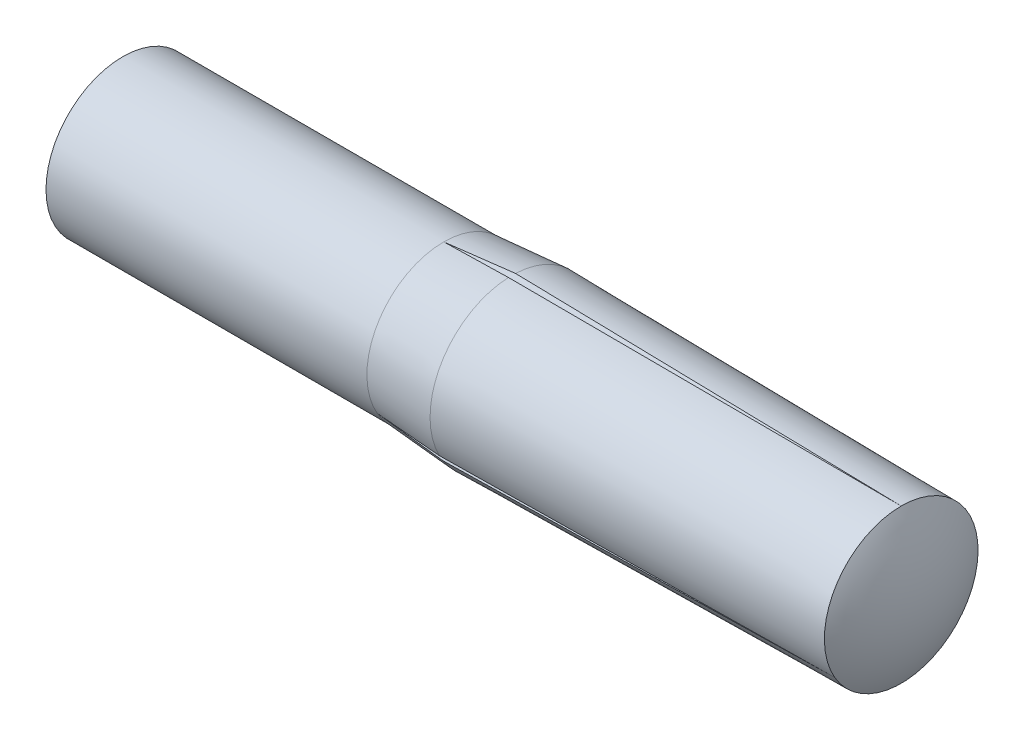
ISO-10303-21;
HEADER;
FILE_DESCRIPTION(('STEP AP214'),'2;1');
FILE_NAME('part.step','',(''),(''),'','','');
FILE_SCHEMA(('AUTOMOTIVE_DESIGN { 1 0 10303 214 1 1 1 1 }'));
ENDSEC;
DATA;
#1=APPLICATION_CONTEXT('core data for automotive mechanical design processes');
#2=APPLICATION_PROTOCOL_DEFINITION('international standard','automotive_design',2000,#1);
#3=PRODUCT_CONTEXT('',#1,'mechanical');
#4=PRODUCT('Part','Part','',(#3));
#5=PRODUCT_RELATED_PRODUCT_CATEGORY('part','',(#4));
#6=PRODUCT_DEFINITION_FORMATION('','',#4);
#7=PRODUCT_DEFINITION_CONTEXT('part definition',#1,'design');
#8=PRODUCT_DEFINITION('design','',#6,#7);
#9=PRODUCT_DEFINITION_SHAPE('','',#8);
#10=(LENGTH_UNIT() NAMED_UNIT(*) SI_UNIT(.MILLI.,.METRE.));
#11=(NAMED_UNIT(*) PLANE_ANGLE_UNIT() SI_UNIT($,.RADIAN.));
#12=(NAMED_UNIT(*) SI_UNIT($,.STERADIAN.) SOLID_ANGLE_UNIT());
#13=UNCERTAINTY_MEASURE_WITH_UNIT(LENGTH_MEASURE(1.E-05),#10,'distance_accuracy_value','');
#14=(GEOMETRIC_REPRESENTATION_CONTEXT(3) GLOBAL_UNCERTAINTY_ASSIGNED_CONTEXT((#13)) GLOBAL_UNIT_ASSIGNED_CONTEXT((#10,
#11,#12)) REPRESENTATION_CONTEXT('',''));
#15=CARTESIAN_POINT('',(0.,0.,0.));
#16=DIRECTION('',(0.,0.,1.));
#17=DIRECTION('',(1.,0.,0.));
#18=AXIS2_PLACEMENT_3D('',#15,#16,#17);
#19=CARTESIAN_POINT('',(4.,0.,0.));
#20=DIRECTION('',(1.,0.,0.));
#21=DIRECTION('',(0.,0.,-1.));
#22=AXIS2_PLACEMENT_3D('',#19,#20,#21);
#23=CONICAL_SURFACE('',#22,0.8,0.0748598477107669);
#24=CARTESIAN_POINT('',(4.0002,-0.429513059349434,-0.674938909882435));
#25=CARTESIAN_POINT('',(3.88900930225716,-0.420554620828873,-0.670761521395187));
#26=CARTESIAN_POINT('',(3.77782506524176,-0.4115312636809,-0.666553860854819));
#27=CARTESIAN_POINT('',(3.55546950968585,-0.393354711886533,-0.658077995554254));
#28=CARTESIAN_POINT('',(3.4442981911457,-0.384201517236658,-0.653809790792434));
#29=CARTESIAN_POINT('',(3.33313333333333,-0.374983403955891,-0.649511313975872));
#30=B_SPLINE_CURVE_WITH_KNOTS('',3,(#24,#25,#26,#27,#28,#29),.UNSPECIFIED.,.F.,.F.,(4,2,4),(0.,
0.334887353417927,0.669774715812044),.UNSPECIFIED.);
#31=CARTESIAN_POINT('',(4.,-0.429496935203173,-0.674931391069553));
#32=VERTEX_POINT('',#31);
#33=CARTESIAN_POINT('',(3.33333333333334,-0.374999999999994,-0.649519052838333));
#34=VERTEX_POINT('',#33);
#35=EDGE_CURVE('E110',#32,#34,#30,.T.);
#36=ORIENTED_EDGE('',*,*,#35,.F.);
#37=CARTESIAN_POINT('',(4.,0.,0.));
#38=DIRECTION('',(-1.,0.,0.));
#39=DIRECTION('',(0.,0.,1.));
#40=AXIS2_PLACEMENT_3D('',#37,#38,#39);
#41=CIRCLE('',#40,0.8);
#42=CARTESIAN_POINT('',(4.,-0.429496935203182,0.674931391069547));
#43=VERTEX_POINT('',#42);
#44=EDGE_CURVE('E65',#32,#43,#41,.T.);
#45=ORIENTED_EDGE('',*,*,#44,.T.);
#46=CARTESIAN_POINT('',(3.33313333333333,-0.374983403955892,0.649511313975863));
#47=CARTESIAN_POINT('',(3.4442981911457,-0.384201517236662,0.653809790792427));
#48=CARTESIAN_POINT('',(3.55546950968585,-0.393354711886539,0.658077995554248));
#49=CARTESIAN_POINT('',(3.77782506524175,-0.411531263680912,0.666553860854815));
#50=CARTESIAN_POINT('',(3.88900930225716,-0.420554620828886,0.670761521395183));
#51=CARTESIAN_POINT('',(4.0002,-0.429513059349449,0.674938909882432));
#52=B_SPLINE_CURVE_WITH_KNOTS('',3,(#46,#47,#48,#49,#50,#51),.UNSPECIFIED.,.F.,.F.,(4,2,4),(0.,
0.334887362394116,0.669774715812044),.UNSPECIFIED.);
#53=CARTESIAN_POINT('',(3.33333333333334,-0.375000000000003,0.649519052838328));
#54=VERTEX_POINT('',#53);
#55=EDGE_CURVE('E114',#54,#43,#52,.T.);
#56=ORIENTED_EDGE('',*,*,#55,.F.);
#57=CARTESIAN_POINT('',(3.33333333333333,0.,0.));
#58=DIRECTION('',(-1.,0.,0.));
#59=DIRECTION('',(0.,0.,1.));
#60=AXIS2_PLACEMENT_3D('',#57,#58,#59);
#61=CIRCLE('',#60,0.75);
#62=EDGE_CURVE('E241',#34,#54,#61,.T.);
#63=ORIENTED_EDGE('',*,*,#62,.F.);
#64=EDGE_LOOP('',(#36,#45,#56,#63));
#65=FACE_BOUND('',#64,.T.);
#66=ADVANCED_FACE('F41',(#65),#23,.T.);
#67=CARTESIAN_POINT('',(3.33313333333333,-0.375001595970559,-0.649500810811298));
#68=CARTESIAN_POINT('',(3.4442981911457,-0.374115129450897,-0.659633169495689));
#69=CARTESIAN_POINT('',(3.55546950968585,-0.373234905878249,-0.669694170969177));
#70=CARTESIAN_POINT('',(3.77782506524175,-0.371486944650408,-0.689673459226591));
#71=CARTESIAN_POINT('',(3.88900930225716,-0.370619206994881,-0.699591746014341));
#72=CARTESIAN_POINT('',(4.0002,-0.369757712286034,-0.709438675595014));
#73=B_SPLINE_CURVE_WITH_KNOTS('',3,(#67,#68,#69,#70,#71,#72),.UNSPECIFIED.,.F.,.F.,(4,2,4),(0.,
0.334887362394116,0.669774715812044),.UNSPECIFIED.);
#74=CARTESIAN_POINT('',(4.,-0.369759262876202,-0.70942095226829));
#75=VERTEX_POINT('',#74);
#76=EDGE_CURVE('E57',#34,#75,#73,.T.);
#77=ORIENTED_EDGE('',*,*,#76,.F.);
#78=CARTESIAN_POINT('',(3.33333333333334,0.75,0.));
#79=VERTEX_POINT('',#78);
#80=EDGE_CURVE('E47',#79,#34,#61,.T.);
#81=ORIENTED_EDGE('',*,*,#80,.F.);
#82=CARTESIAN_POINT('',(4.0002,0.799270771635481,-0.0344997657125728));
#83=CARTESIAN_POINT('',(3.88900930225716,0.791173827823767,-0.0288302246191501));
#84=CARTESIAN_POINT('',(3.77782506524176,0.783018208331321,-0.0231195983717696));
#85=CARTESIAN_POINT('',(3.55546950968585,0.766589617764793,-0.0116161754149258));
#86=CARTESIAN_POINT('',(3.4442981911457,0.758316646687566,-0.00582337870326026));
#87=CARTESIAN_POINT('',(3.33313333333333,0.749984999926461,1.05031645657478E-05));
#88=B_SPLINE_CURVE_WITH_KNOTS('',3,(#82,#83,#84,#85,#86,#87),.UNSPECIFIED.,.F.,.F.,(4,2,4),(0.,
0.334887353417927,0.669774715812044),.UNSPECIFIED.);
#89=CARTESIAN_POINT('',(4.,0.799256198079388,-0.034489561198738));
#90=VERTEX_POINT('',#89);
#91=EDGE_CURVE('E134',#90,#79,#88,.T.);
#92=ORIENTED_EDGE('',*,*,#91,.F.);
#93=EDGE_CURVE('E130',#90,#75,#41,.T.);
#94=ORIENTED_EDGE('',*,*,#93,.T.);
#95=EDGE_LOOP('',(#77,#81,#92,#94));
#96=FACE_BOUND('',#95,.T.);
#97=ADVANCED_FACE('F246',(#96),#23,.T.);
#98=CARTESIAN_POINT('',(7.8,0.,0.));
#99=DIRECTION('',(-1.,0.,0.));
#100=DIRECTION('',(0.,0.,1.));
#101=AXIS2_PLACEMENT_3D('',#98,#99,#100);
#102=CONICAL_SURFACE('',#101,0.75,0.0131571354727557);
#103=CARTESIAN_POINT('',(7.8002,-0.374997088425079,-0.649517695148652));
#104=CARTESIAN_POINT('',(7.30675825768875,-0.382176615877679,-0.652865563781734));
#105=CARTESIAN_POINT('',(6.81331581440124,-0.38931605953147,-0.656194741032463));
#106=CARTESIAN_POINT('',(5.54651683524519,-0.407541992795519,-0.664693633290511));
#107=CARTESIAN_POINT('',(4.77315927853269,-0.41857010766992,-0.669836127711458));
#108=CARTESIAN_POINT('',(3.9998,-0.429499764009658,-0.67493271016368));
#109=B_SPLINE_CURVE_WITH_KNOTS('',3,(#103,#104,#105,#106,#107,#108),.UNSPECIFIED.,.F.,.F.,(4,2,
4),(0.,1.4805159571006,3.80087579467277),.UNSPECIFIED.);
#110=CARTESIAN_POINT('',(7.8,-0.374999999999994,-0.649519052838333));
#111=VERTEX_POINT('',#110);
#112=EDGE_CURVE('E106',#111,#32,#109,.T.);
#113=ORIENTED_EDGE('',*,*,#112,.F.);
#114=CARTESIAN_POINT('',(7.8,0.,0.));
#115=DIRECTION('',(-1.,0.,0.));
#116=DIRECTION('',(0.,0.,1.));
#117=AXIS2_PLACEMENT_3D('',#114,#115,#116);
#118=CIRCLE('',#117,0.75);
#119=CARTESIAN_POINT('',(7.8,-0.375000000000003,0.649519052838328));
#120=VERTEX_POINT('',#119);
#121=EDGE_CURVE('E113',#111,#120,#118,.T.);
#122=ORIENTED_EDGE('',*,*,#121,.T.);
#123=CARTESIAN_POINT('',(3.9998,-0.429499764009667,0.674932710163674));
#124=CARTESIAN_POINT('',(4.52614523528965,-0.422059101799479,0.671463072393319));
#125=CARTESIAN_POINT('',(5.05248968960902,-0.414573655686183,0.667972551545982));
#126=CARTESIAN_POINT('',(6.31929045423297,-0.396449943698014,0.659521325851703));
#127=CARTESIAN_POINT('',(7.0597459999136,-0.385767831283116,0.654540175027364));
#128=CARTESIAN_POINT('',(7.8002,-0.374997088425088,0.649517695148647));
#129=B_SPLINE_CURVE_WITH_KNOTS('',3,(#123,#124,#125,#126,#127,#128),.UNSPECIFIED.,.F.,.F.,(4,2,
4),(0.,1.57922775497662,3.8008757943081),.UNSPECIFIED.);
#130=EDGE_CURVE('E204',#43,#120,#129,.T.);
#131=ORIENTED_EDGE('',*,*,#130,.F.);
#132=ORIENTED_EDGE('',*,*,#44,.F.);
#133=EDGE_LOOP('',(#113,#122,#131,#132));
#134=FACE_BOUND('',#133,.T.);
#135=ADVANCED_FACE('F111',(#134),#102,.T.);
#136=CARTESIAN_POINT('',(3.9998,-0.369758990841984,-0.709424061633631));
#137=CARTESIAN_POINT('',(4.52614523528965,-0.370474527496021,-0.701245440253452));
#138=CARTESIAN_POINT('',(5.05248968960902,-0.371194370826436,-0.693017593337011));
#139=CARTESIAN_POINT('',(6.31929045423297,-0.37293725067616,-0.673096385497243));
#140=CARTESIAN_POINT('',(7.0597459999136,-0.373964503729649,-0.661354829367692));
#141=CARTESIAN_POINT('',(7.8002,-0.375000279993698,-0.649515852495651));
#142=B_SPLINE_CURVE_WITH_KNOTS('',3,(#136,#137,#138,#139,#140,#141),.UNSPECIFIED.,.F.,.F.,(4,2,
4),(0.,1.57922775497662,3.8008757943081),.UNSPECIFIED.);
#143=EDGE_CURVE('E92',#75,#111,#142,.T.);
#144=ORIENTED_EDGE('',*,*,#143,.F.);
#145=ORIENTED_EDGE('',*,*,#93,.F.);
#146=CARTESIAN_POINT('',(7.8002,0.749997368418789,1.84265300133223E-06));
#147=CARTESIAN_POINT('',(7.30675825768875,0.756486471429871,-0.00454187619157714));
#148=CARTESIAN_POINT('',(6.81331581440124,0.762939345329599,-0.00906022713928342));
#149=CARTESIAN_POINT('',(5.54651683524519,0.77941256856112,-0.0205949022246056));
#150=CARTESIAN_POINT('',(4.77315927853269,0.78938015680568,-0.0275742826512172));
#151=CARTESIAN_POINT('',(3.9998,0.799258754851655,-0.0344913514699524));
#152=B_SPLINE_CURVE_WITH_KNOTS('',3,(#146,#147,#148,#149,#150,#151),.UNSPECIFIED.,.F.,.F.,(4,2,
4),(0.,1.4805159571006,3.80087579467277),.UNSPECIFIED.);
#153=CARTESIAN_POINT('',(7.8,0.75,0.));
#154=VERTEX_POINT('',#153);
#155=EDGE_CURVE('E128',#154,#90,#152,.T.);
#156=ORIENTED_EDGE('',*,*,#155,.F.);
#157=EDGE_CURVE('E122',#154,#111,#118,.T.);
#158=ORIENTED_EDGE('',*,*,#157,.T.);
#159=EDGE_LOOP('',(#144,#145,#156,#158));
#160=FACE_BOUND('',#159,.T.);
#161=ADVANCED_FACE('F123',(#160),#102,.T.);
#162=CARTESIAN_POINT('',(4.0002,-0.369757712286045,0.709438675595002));
#163=CARTESIAN_POINT('',(3.88900930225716,-0.370619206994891,0.699591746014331));
#164=CARTESIAN_POINT('',(3.77782506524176,-0.371486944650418,0.689673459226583));
#165=CARTESIAN_POINT('',(3.55546950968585,-0.373234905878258,0.669694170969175));
#166=CARTESIAN_POINT('',(3.4442981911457,-0.374115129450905,0.659633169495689));
#167=CARTESIAN_POINT('',(3.33313333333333,-0.375001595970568,0.649500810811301));
#168=B_SPLINE_CURVE_WITH_KNOTS('',3,(#162,#163,#164,#165,#166,#167),.UNSPECIFIED.,.F.,.F.,(4,2,
4),(0.,0.334887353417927,0.669774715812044),.UNSPECIFIED.);
#169=CARTESIAN_POINT('',(4.,-0.369759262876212,0.709420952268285));
#170=VERTEX_POINT('',#169);
#171=EDGE_CURVE('E191',#170,#54,#168,.T.);
#172=ORIENTED_EDGE('',*,*,#171,.F.);
#173=CARTESIAN_POINT('',(4.,0.799256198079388,0.034489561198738));
#174=VERTEX_POINT('',#173);
#175=EDGE_CURVE('E129',#170,#174,#41,.T.);
#176=ORIENTED_EDGE('',*,*,#175,.T.);
#177=CARTESIAN_POINT('',(3.33313333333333,0.749984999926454,-1.05031645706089E-05));
#178=CARTESIAN_POINT('',(3.4442981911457,0.758316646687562,0.0058233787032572));
#179=CARTESIAN_POINT('',(3.55546950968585,0.766589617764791,0.0116161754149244));
#180=CARTESIAN_POINT('',(3.77782506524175,0.783018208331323,0.023119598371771));
#181=CARTESIAN_POINT('',(3.88900930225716,0.791173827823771,0.0288302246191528));
#182=CARTESIAN_POINT('',(4.0002,0.799270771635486,0.0344997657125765));
#183=B_SPLINE_CURVE_WITH_KNOTS('',3,(#177,#178,#179,#180,#181,#182),.UNSPECIFIED.,.F.,.F.,(4,2,
4),(0.,0.334887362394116,0.669774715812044),.UNSPECIFIED.);
#184=EDGE_CURVE('E142',#79,#174,#183,.T.);
#185=ORIENTED_EDGE('',*,*,#184,.F.);
#186=EDGE_CURVE('E199',#54,#79,#61,.T.);
#187=ORIENTED_EDGE('',*,*,#186,.F.);
#188=EDGE_LOOP('',(#172,#176,#185,#187));
#189=FACE_BOUND('',#188,.T.);
#190=ADVANCED_FACE('F152',(#189),#23,.T.);
#191=CARTESIAN_POINT('',(7.8002,-0.375000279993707,0.649515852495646));
#192=CARTESIAN_POINT('',(7.30675825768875,-0.374309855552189,0.657407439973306));
#193=CARTESIAN_POINT('',(6.81331581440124,-0.373623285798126,0.665254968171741));
#194=CARTESIAN_POINT('',(5.54651683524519,-0.371870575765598,0.685288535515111));
#195=CARTESIAN_POINT('',(4.77315927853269,-0.370810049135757,0.697410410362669));
#196=CARTESIAN_POINT('',(3.9998,-0.369758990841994,0.709424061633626));
#197=B_SPLINE_CURVE_WITH_KNOTS('',3,(#191,#192,#193,#194,#195,#196),.UNSPECIFIED.,.F.,.F.,(4,2,
4),(0.,1.4805159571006,3.80087579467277),.UNSPECIFIED.);
#198=EDGE_CURVE('E194',#120,#170,#197,.T.);
#199=ORIENTED_EDGE('',*,*,#198,.F.);
#200=EDGE_CURVE('E125',#120,#154,#118,.T.);
#201=ORIENTED_EDGE('',*,*,#200,.T.);
#202=CARTESIAN_POINT('',(3.9998,0.799258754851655,0.0344913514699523));
#203=CARTESIAN_POINT('',(4.52614523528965,0.792533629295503,0.0297823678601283));
#204=CARTESIAN_POINT('',(5.05248968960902,0.785768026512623,0.0250450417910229));
#205=CARTESIAN_POINT('',(6.31929045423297,0.769387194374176,0.0135750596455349));
#206=CARTESIAN_POINT('',(7.0597459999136,0.759732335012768,0.00681465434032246));
#207=CARTESIAN_POINT('',(7.8002,0.74999736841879,-1.84265300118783E-06));
#208=B_SPLINE_CURVE_WITH_KNOTS('',3,(#202,#203,#204,#205,#206,#207),.UNSPECIFIED.,.F.,.F.,(4,2,
4),(0.,1.57922775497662,3.8008757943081),.UNSPECIFIED.);
#209=EDGE_CURVE('E173',#174,#154,#208,.T.);
#210=ORIENTED_EDGE('',*,*,#209,.F.);
#211=ORIENTED_EDGE('',*,*,#175,.F.);
#212=EDGE_LOOP('',(#199,#201,#210,#211));
#213=FACE_BOUND('',#212,.T.);
#214=ADVANCED_FACE('F166',(#213),#102,.T.);
#215=CARTESIAN_POINT('',(1.50625,0.,0.));
#216=DIRECTION('',(-1.,0.,0.));
#217=DIRECTION('',(0.,1.,0.));
#218=AXIS2_PLACEMENT_3D('',#215,#216,#217);
#219=SPHERICAL_SURFACE('',#218,1.50625);
#220=CARTESIAN_POINT('',(0.2,0.,0.));
#221=DIRECTION('',(-1.,0.,0.));
#222=DIRECTION('',(0.,0.,1.));
#223=AXIS2_PLACEMENT_3D('',#220,#221,#222);
#224=CIRCLE('',#223,0.75);
#225=CARTESIAN_POINT('',(0.2,0.,0.75));
#226=VERTEX_POINT('',#225);
#227=EDGE_CURVE('E11',#226,#226,#224,.T.);
#228=ORIENTED_EDGE('',*,*,#227,.T.);
#229=EDGE_LOOP('',(#228));
#230=FACE_BOUND('',#229,.T.);
#231=ADVANCED_FACE('F43',(#230),#219,.T.);
#232=CARTESIAN_POINT('',(0.,0.,0.));
#233=DIRECTION('',(-1.,0.,0.));
#234=DIRECTION('',(0.,0.,1.));
#235=AXIS2_PLACEMENT_3D('',#232,#233,#234);
#236=CYLINDRICAL_SURFACE('',#235,0.75);
#237=ORIENTED_EDGE('',*,*,#80,.T.);
#238=ORIENTED_EDGE('',*,*,#62,.T.);
#239=ORIENTED_EDGE('',*,*,#186,.T.);
#240=EDGE_LOOP('',(#237,#238,#239));
#241=FACE_BOUND('',#240,.T.);
#242=ORIENTED_EDGE('',*,*,#227,.F.);
#243=EDGE_LOOP('',(#242));
#244=FACE_BOUND('',#243,.T.);
#245=ADVANCED_FACE('F170',(#241,#244),#236,.T.);
#246=CARTESIAN_POINT('',(6.49375,0.,0.));
#247=DIRECTION('',(-1.,0.,0.));
#248=DIRECTION('',(0.,1.,0.));
#249=AXIS2_PLACEMENT_3D('',#246,#247,#248);
#250=SPHERICAL_SURFACE('',#249,1.50625);
#251=ORIENTED_EDGE('',*,*,#157,.F.);
#252=ORIENTED_EDGE('',*,*,#200,.F.);
#253=ORIENTED_EDGE('',*,*,#121,.F.);
#254=EDGE_LOOP('',(#251,#252,#253));
#255=FACE_BOUND('',#254,.T.);
#256=ADVANCED_FACE('F119',(#255),#250,.T.);
#257=CARTESIAN_POINT('',(8.,0.85,-0.0700207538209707));
#258=DIRECTION('',(0.,0.573576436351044,0.819152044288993));
#259=DIRECTION('',(0.,-0.819152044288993,0.573576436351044));
#260=AXIS2_PLACEMENT_3D('',#257,#258,#259);
#261=PLANE('',#260);
#262=ORIENTED_EDGE('',*,*,#91,.T.);
#263=DIRECTION('',(-1.,0.,0.));
#264=VECTOR('',#263,1.);
#265=CARTESIAN_POINT('',(8.,0.75,0.));
#266=LINE('',#265,#264);
#267=EDGE_CURVE('E177',#154,#79,#266,.T.);
#268=ORIENTED_EDGE('',*,*,#267,.F.);
#269=ORIENTED_EDGE('',*,*,#155,.T.);
#270=EDGE_LOOP('',(#262,#268,#269));
#271=FACE_BOUND('',#270,.T.);
#272=ADVANCED_FACE('F159',(#271),#261,.T.);
#273=CARTESIAN_POINT('',(8.,0.75,0.));
#274=DIRECTION('',(0.,0.573576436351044,-0.819152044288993));
#275=DIRECTION('',(0.,0.819152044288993,0.573576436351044));
#276=AXIS2_PLACEMENT_3D('',#273,#274,#275);
#277=PLANE('',#276);
#278=ORIENTED_EDGE('',*,*,#184,.T.);
#279=ORIENTED_EDGE('',*,*,#209,.T.);
#280=ORIENTED_EDGE('',*,*,#267,.T.);
#281=EDGE_LOOP('',(#278,#279,#280));
#282=FACE_BOUND('',#281,.T.);
#283=ADVANCED_FACE('F162',(#282),#277,.T.);
#284=CARTESIAN_POINT('',(8.,-0.364360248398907,0.771131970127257));
#285=DIRECTION('',(0.,-0.996194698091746,0.0871557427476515));
#286=DIRECTION('',(0.,-0.0871557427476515,-0.996194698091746));
#287=AXIS2_PLACEMENT_3D('',#284,#285,#286);
#288=PLANE('',#287);
#289=ORIENTED_EDGE('',*,*,#171,.T.);
#290=DIRECTION('',(-1.,0.,0.));
#291=VECTOR('',#290,1.);
#292=CARTESIAN_POINT('',(8.,-0.375000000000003,0.649519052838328));
#293=LINE('',#292,#291);
#294=EDGE_CURVE('E198',#120,#54,#293,.T.);
#295=ORIENTED_EDGE('',*,*,#294,.F.);
#296=ORIENTED_EDGE('',*,*,#198,.T.);
#297=EDGE_LOOP('',(#289,#295,#296));
#298=FACE_BOUND('',#297,.T.);
#299=ADVANCED_FACE('F219',(#298),#288,.T.);
#300=CARTESIAN_POINT('',(8.,-0.375000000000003,0.649519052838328));
#301=DIRECTION('',(0.,0.422618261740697,0.906307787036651));
#302=DIRECTION('',(0.,-0.906307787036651,0.422618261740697));
#303=AXIS2_PLACEMENT_3D('',#300,#301,#302);
#304=PLANE('',#303);
#305=ORIENTED_EDGE('',*,*,#55,.T.);
#306=ORIENTED_EDGE('',*,*,#130,.T.);
#307=ORIENTED_EDGE('',*,*,#294,.T.);
#308=EDGE_LOOP('',(#305,#306,#307));
#309=FACE_BOUND('',#308,.T.);
#310=ADVANCED_FACE('F217',(#309),#304,.T.);
#311=CARTESIAN_POINT('',(8.,-0.485639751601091,-0.701111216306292));
#312=DIRECTION('',(0.,0.42261826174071,-0.906307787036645));
#313=DIRECTION('',(0.,0.906307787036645,0.42261826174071));
#314=AXIS2_PLACEMENT_3D('',#311,#312,#313);
#315=PLANE('',#314);
#316=ORIENTED_EDGE('',*,*,#35,.T.);
#317=DIRECTION('',(-1.,0.,0.));
#318=VECTOR('',#317,1.);
#319=CARTESIAN_POINT('',(8.,-0.374999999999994,-0.649519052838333));
#320=LINE('',#319,#318);
#321=EDGE_CURVE('E98',#111,#34,#320,.T.);
#322=ORIENTED_EDGE('',*,*,#321,.F.);
#323=ORIENTED_EDGE('',*,*,#112,.T.);
#324=EDGE_LOOP('',(#316,#322,#323));
#325=FACE_BOUND('',#324,.T.);
#326=ADVANCED_FACE('F102',(#325),#315,.T.);
#327=CARTESIAN_POINT('',(8.,-0.374999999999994,-0.649519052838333));
#328=DIRECTION('',(0.,-0.996194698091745,-0.0871557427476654));
#329=DIRECTION('',(0.,0.0871557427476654,-0.996194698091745));
#330=AXIS2_PLACEMENT_3D('',#327,#328,#329);
#331=PLANE('',#330);
#332=ORIENTED_EDGE('',*,*,#76,.T.);
#333=ORIENTED_EDGE('',*,*,#143,.T.);
#334=ORIENTED_EDGE('',*,*,#321,.T.);
#335=EDGE_LOOP('',(#332,#333,#334));
#336=FACE_BOUND('',#335,.T.);
#337=ADVANCED_FACE('F91',(#336),#331,.T.);
#338=CLOSED_SHELL('',(#66,#97,#135,#161,#190,#214,#231,#245,#256,#272,#283,#299,#310,#326,#337));
#339=MANIFOLD_SOLID_BREP('B2',#338);
#340=ADVANCED_BREP_SHAPE_REPRESENTATION('',(#18,#339),#14);
#341=SHAPE_DEFINITION_REPRESENTATION(#9,#340);
ENDSEC;
END-ISO-10303-21;
